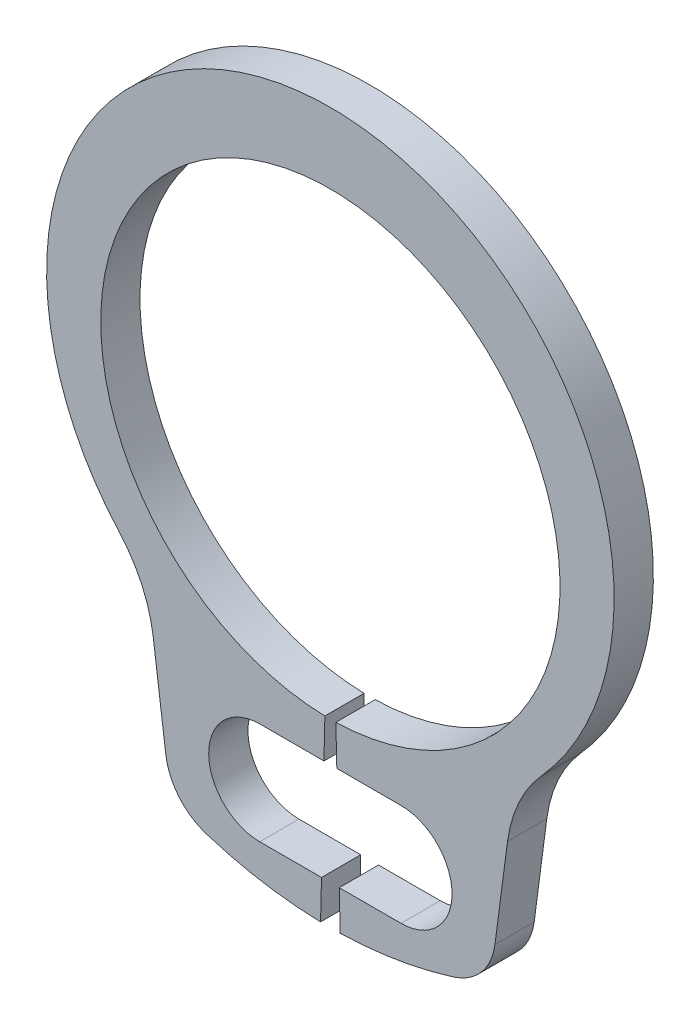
from build123d import *

# Parameters (mm, degrees)
BODYSKE_R   = 0.3302
BODY_DEPTH  = 0.254
NOTSKE_W    = 0.9144
NOTSKE_H    = 0.6604
NOTCH_DEPTH = 4.236858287


with BuildPart() as part:
    # BodySke → Body (new body)
    with BuildSketch(Plane.XY):
        with BuildLine():
            Line((0.035547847, -1.485474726), (0.0635, -2.653540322))
            ThreePointArc((0.0635, -2.653540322), (0.437275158, -2.618033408), (0.802300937, -2.530142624))
            ThreePointArc((0.802300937, -2.530142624), (0.97920115, -2.411627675), (1.064878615, -2.216694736))
            Line((1.064878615, -2.216694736), (1.146405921, -1.597433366))
            ThreePointArc((1.146405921, -1.597433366), (1.220159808, -1.342000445), (1.366192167, -1.119828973))
            ThreePointArc((1.366192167, -1.119828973), (0, 1.9431), (-1.366192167, -1.119828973))
            ThreePointArc((-1.366192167, -1.119828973), (-1.220159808, -1.342000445), (-1.146405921, -1.597433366))
            Line((-1.146405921, -1.597433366), (-1.064878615, -2.216694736))
            ThreePointArc((-1.064878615, -2.216694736), (-0.97920115, -2.411627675), (-0.802300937, -2.530142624))
            ThreePointArc((-0.802300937, -2.530142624), (-0.437275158, -2.618033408), (-0.0635, -2.653540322))
            Line((-0.0635, -2.653540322), (-0.035547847, -1.485474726))
            ThreePointArc((-0.035547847, -1.485474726), (0, 1.4859), (0.035547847, -1.485474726))
        make_face()
        with Locations((0.4572, -2.071034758)):
            Circle(BODYSKE_R, mode=Mode.SUBTRACT)
        with Locations((-0.4572, -2.071034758)):
            Circle(BODYSKE_R, mode=Mode.SUBTRACT)
    extrude(amount=-BODY_DEPTH)

    # NotSke → Notch (cut, through all)
    with BuildSketch(Plane.XY):
        with Locations((0, -2.071034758)):
            Rectangle(NOTSKE_W, NOTSKE_H)
    extrude(amount=-NOTCH_DEPTH, mode=Mode.SUBTRACT)


solid = part.part
